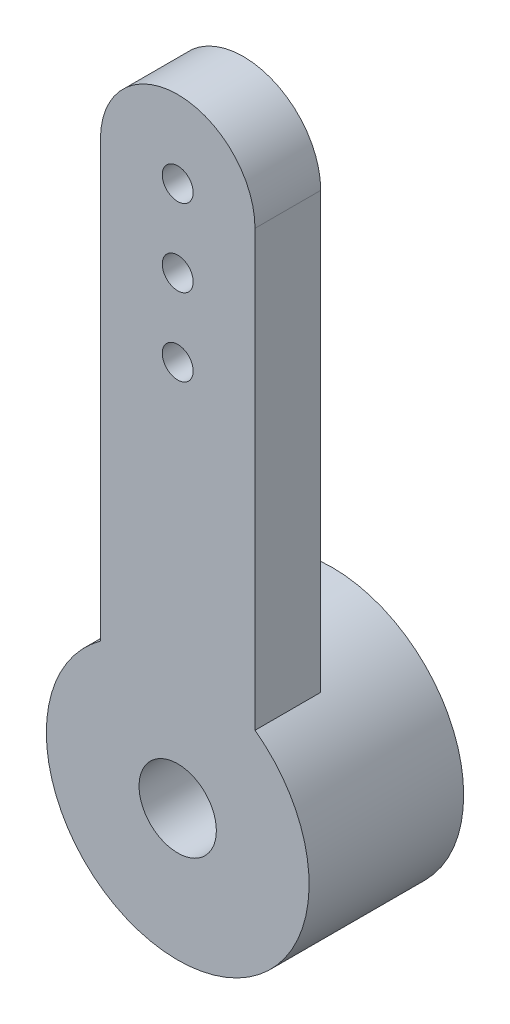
ISO-10303-21;
HEADER;
FILE_DESCRIPTION(('STEP AP214'),'2;1');
FILE_NAME('part.step','',(''),(''),'','','');
FILE_SCHEMA(('AUTOMOTIVE_DESIGN { 1 0 10303 214 1 1 1 1 }'));
ENDSEC;
DATA;
#1=APPLICATION_CONTEXT('core data for automotive mechanical design processes');
#2=APPLICATION_PROTOCOL_DEFINITION('international standard','automotive_design',2000,#1);
#3=PRODUCT_CONTEXT('',#1,'mechanical');
#4=PRODUCT('Part','Part','',(#3));
#5=PRODUCT_RELATED_PRODUCT_CATEGORY('part','',(#4));
#6=PRODUCT_DEFINITION_FORMATION('','',#4);
#7=PRODUCT_DEFINITION_CONTEXT('part definition',#1,'design');
#8=PRODUCT_DEFINITION('design','',#6,#7);
#9=PRODUCT_DEFINITION_SHAPE('','',#8);
#10=(LENGTH_UNIT() NAMED_UNIT(*) SI_UNIT(.MILLI.,.METRE.));
#11=(NAMED_UNIT(*) PLANE_ANGLE_UNIT() SI_UNIT($,.RADIAN.));
#12=(NAMED_UNIT(*) SI_UNIT($,.STERADIAN.) SOLID_ANGLE_UNIT());
#13=UNCERTAINTY_MEASURE_WITH_UNIT(LENGTH_MEASURE(1.E-05),#10,'distance_accuracy_value','');
#14=(GEOMETRIC_REPRESENTATION_CONTEXT(3) GLOBAL_UNCERTAINTY_ASSIGNED_CONTEXT((#13)) GLOBAL_UNIT_ASSIGNED_CONTEXT((#10,
#11,#12)) REPRESENTATION_CONTEXT('',''));
#15=CARTESIAN_POINT('',(0.,0.,0.));
#16=DIRECTION('',(0.,0.,1.));
#17=DIRECTION('',(1.,0.,0.));
#18=AXIS2_PLACEMENT_3D('',#15,#16,#17);
#19=CARTESIAN_POINT('',(0.,0.,0.));
#20=DIRECTION('',(0.,0.,1.));
#21=DIRECTION('',(1.,0.,0.));
#22=AXIS2_PLACEMENT_3D('',#19,#20,#21);
#23=PLANE('',#22);
#24=CARTESIAN_POINT('',(0.,0.,0.));
#25=DIRECTION('',(0.,0.,1.));
#26=DIRECTION('',(1.,0.,0.));
#27=AXIS2_PLACEMENT_3D('',#24,#25,#26);
#28=CIRCLE('',#27,1.);
#29=CARTESIAN_POINT('',(1.,0.,0.));
#30=VERTEX_POINT('',#29);
#31=EDGE_CURVE('E135',#30,#30,#28,.T.);
#32=ORIENTED_EDGE('',*,*,#31,.T.);
#33=EDGE_LOOP('',(#32));
#34=FACE_BOUND('',#33,.T.);
#35=CARTESIAN_POINT('',(0.,0.,0.));
#36=DIRECTION('',(0.,0.,-1.));
#37=DIRECTION('',(-1.,0.,0.));
#38=AXIS2_PLACEMENT_3D('',#35,#36,#37);
#39=CIRCLE('',#38,2.4);
#40=CARTESIAN_POINT('',(-2.4,0.,0.));
#41=VERTEX_POINT('',#40);
#42=EDGE_CURVE('E290',#41,#41,#39,.T.);
#43=ORIENTED_EDGE('',*,*,#42,.T.);
#44=EDGE_LOOP('',(#43));
#45=FACE_BOUND('',#44,.T.);
#46=ADVANCED_FACE('F33',(#34,#45),#23,.F.);
#47=CARTESIAN_POINT('',(0.,0.,1.7));
#48=DIRECTION('',(0.,0.,1.));
#49=DIRECTION('',(1.,0.,0.));
#50=AXIS2_PLACEMENT_3D('',#47,#48,#49);
#51=PLANE('',#50);
#52=CARTESIAN_POINT('',(0.,12.,1.7));
#53=DIRECTION('',(0.,0.,1.));
#54=DIRECTION('',(1.,0.,0.));
#55=AXIS2_PLACEMENT_3D('',#52,#53,#54);
#56=CIRCLE('',#55,0.4);
#57=CARTESIAN_POINT('',(0.400000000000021,12.,1.7));
#58=VERTEX_POINT('',#57);
#59=EDGE_CURVE('E126',#58,#58,#56,.T.);
#60=ORIENTED_EDGE('',*,*,#59,.F.);
#61=EDGE_LOOP('',(#60));
#62=FACE_BOUND('',#61,.T.);
#63=CARTESIAN_POINT('',(0.,0.,1.7));
#64=DIRECTION('',(0.,0.,1.));
#65=DIRECTION('',(1.,0.,0.));
#66=AXIS2_PLACEMENT_3D('',#63,#64,#65);
#67=CIRCLE('',#66,1.);
#68=CARTESIAN_POINT('',(1.,0.,1.7));
#69=VERTEX_POINT('',#68);
#70=EDGE_CURVE('E113',#69,#69,#67,.T.);
#71=ORIENTED_EDGE('',*,*,#70,.F.);
#72=EDGE_LOOP('',(#71));
#73=FACE_BOUND('',#72,.T.);
#74=CARTESIAN_POINT('',(0.,0.,1.7));
#75=DIRECTION('',(0.,0.,1.));
#76=DIRECTION('',(1.,0.,0.));
#77=AXIS2_PLACEMENT_3D('',#74,#75,#76);
#78=CIRCLE('',#77,3.4);
#79=CARTESIAN_POINT('',(-2.,2.7495454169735,1.7));
#80=VERTEX_POINT('',#79);
#81=CARTESIAN_POINT('',(2.,2.7495454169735,1.7));
#82=VERTEX_POINT('',#81);
#83=EDGE_CURVE('E99',#80,#82,#78,.T.);
#84=ORIENTED_EDGE('',*,*,#83,.T.);
#85=DIRECTION('',(0.,1.,0.));
#86=VECTOR('',#85,1.);
#87=CARTESIAN_POINT('',(2.,14.,1.7));
#88=LINE('',#87,#86);
#89=CARTESIAN_POINT('',(2.,14.,1.7));
#90=VERTEX_POINT('',#89);
#91=EDGE_CURVE('E78',#82,#90,#88,.T.);
#92=ORIENTED_EDGE('',*,*,#91,.T.);
#93=CARTESIAN_POINT('',(0.,14.,1.7));
#94=DIRECTION('',(0.,0.,1.));
#95=DIRECTION('',(1.,0.,0.));
#96=AXIS2_PLACEMENT_3D('',#93,#94,#95);
#97=CIRCLE('',#96,2.);
#98=CARTESIAN_POINT('',(-2.,14.,1.7));
#99=VERTEX_POINT('',#98);
#100=EDGE_CURVE('E103',#90,#99,#97,.T.);
#101=ORIENTED_EDGE('',*,*,#100,.T.);
#102=DIRECTION('',(0.,-1.,0.));
#103=VECTOR('',#102,1.);
#104=CARTESIAN_POINT('',(-2.,14.,1.7));
#105=LINE('',#104,#103);
#106=EDGE_CURVE('E52',#99,#80,#105,.T.);
#107=ORIENTED_EDGE('',*,*,#106,.T.);
#108=EDGE_LOOP('',(#84,#92,#101,#107));
#109=FACE_BOUND('',#108,.T.);
#110=CARTESIAN_POINT('',(0.,14.,1.7));
#111=DIRECTION('',(0.,0.,1.));
#112=DIRECTION('',(1.,0.,0.));
#113=AXIS2_PLACEMENT_3D('',#110,#111,#112);
#114=CIRCLE('',#113,0.4);
#115=CARTESIAN_POINT('',(0.4,14.,1.7));
#116=VERTEX_POINT('',#115);
#117=EDGE_CURVE('E132',#116,#116,#114,.T.);
#118=ORIENTED_EDGE('',*,*,#117,.F.);
#119=EDGE_LOOP('',(#118));
#120=FACE_BOUND('',#119,.T.);
#121=CARTESIAN_POINT('',(0.,10.,1.7));
#122=DIRECTION('',(0.,0.,1.));
#123=DIRECTION('',(1.,0.,0.));
#124=AXIS2_PLACEMENT_3D('',#121,#122,#123);
#125=CIRCLE('',#124,0.4);
#126=CARTESIAN_POINT('',(0.400000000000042,10.,1.7));
#127=VERTEX_POINT('',#126);
#128=EDGE_CURVE('E119',#127,#127,#125,.T.);
#129=ORIENTED_EDGE('',*,*,#128,.F.);
#130=EDGE_LOOP('',(#129));
#131=FACE_BOUND('',#130,.T.);
#132=ADVANCED_FACE('F146',(#62,#73,#109,#120,#131),#51,.T.);
#133=CARTESIAN_POINT('',(0.,0.,0.));
#134=DIRECTION('',(0.,0.,-1.));
#135=DIRECTION('',(-1.,0.,0.));
#136=AXIS2_PLACEMENT_3D('',#133,#134,#135);
#137=CIRCLE('',#136,3.4);
#138=CARTESIAN_POINT('',(-2.,2.7495454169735,0.));
#139=VERTEX_POINT('',#138);
#140=CARTESIAN_POINT('',(2.,2.7495454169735,0.));
#141=VERTEX_POINT('',#140);
#142=EDGE_CURVE('E83',#139,#141,#137,.T.);
#143=ORIENTED_EDGE('',*,*,#142,.F.);
#144=DIRECTION('',(0.,-1.,0.));
#145=VECTOR('',#144,1.);
#146=CARTESIAN_POINT('',(-2.,14.,0.));
#147=LINE('',#146,#145);
#148=CARTESIAN_POINT('',(-2.,14.,0.));
#149=VERTEX_POINT('',#148);
#150=EDGE_CURVE('E87',#149,#139,#147,.T.);
#151=ORIENTED_EDGE('',*,*,#150,.F.);
#152=CARTESIAN_POINT('',(0.,14.,0.));
#153=DIRECTION('',(0.,0.,1.));
#154=DIRECTION('',(1.,0.,0.));
#155=AXIS2_PLACEMENT_3D('',#152,#153,#154);
#156=CIRCLE('',#155,2.);
#157=CARTESIAN_POINT('',(2.,14.,0.));
#158=VERTEX_POINT('',#157);
#159=EDGE_CURVE('E73',#158,#149,#156,.T.);
#160=ORIENTED_EDGE('',*,*,#159,.F.);
#161=DIRECTION('',(0.,1.,0.));
#162=VECTOR('',#161,1.);
#163=CARTESIAN_POINT('',(2.,14.,0.));
#164=LINE('',#163,#162);
#165=EDGE_CURVE('E66',#141,#158,#164,.T.);
#166=ORIENTED_EDGE('',*,*,#165,.F.);
#167=EDGE_LOOP('',(#143,#151,#160,#166));
#168=FACE_BOUND('',#167,.T.);
#169=CARTESIAN_POINT('',(0.,14.,0.));
#170=DIRECTION('',(0.,0.,1.));
#171=DIRECTION('',(1.,0.,0.));
#172=AXIS2_PLACEMENT_3D('',#169,#170,#171);
#173=CIRCLE('',#172,0.4);
#174=CARTESIAN_POINT('',(0.4,14.,0.));
#175=VERTEX_POINT('',#174);
#176=EDGE_CURVE('E129',#175,#175,#173,.T.);
#177=ORIENTED_EDGE('',*,*,#176,.T.);
#178=EDGE_LOOP('',(#177));
#179=FACE_BOUND('',#178,.T.);
#180=CARTESIAN_POINT('',(0.,12.,0.));
#181=DIRECTION('',(0.,0.,1.));
#182=DIRECTION('',(1.,0.,0.));
#183=AXIS2_PLACEMENT_3D('',#180,#181,#182);
#184=CIRCLE('',#183,0.4);
#185=CARTESIAN_POINT('',(0.400000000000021,12.,0.));
#186=VERTEX_POINT('',#185);
#187=EDGE_CURVE('E122',#186,#186,#184,.T.);
#188=ORIENTED_EDGE('',*,*,#187,.T.);
#189=EDGE_LOOP('',(#188));
#190=FACE_BOUND('',#189,.T.);
#191=CARTESIAN_POINT('',(0.,10.,0.));
#192=DIRECTION('',(0.,0.,1.));
#193=DIRECTION('',(1.,0.,0.));
#194=AXIS2_PLACEMENT_3D('',#191,#192,#193);
#195=CIRCLE('',#194,0.4);
#196=CARTESIAN_POINT('',(0.400000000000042,10.,0.));
#197=VERTEX_POINT('',#196);
#198=EDGE_CURVE('E123',#197,#197,#195,.T.);
#199=ORIENTED_EDGE('',*,*,#198,.T.);
#200=EDGE_LOOP('',(#199));
#201=FACE_BOUND('',#200,.T.);
#202=ADVANCED_FACE('F85',(#168,#179,#190,#201),#23,.F.);
#203=CARTESIAN_POINT('',(0.,0.,1.7));
#204=DIRECTION('',(0.,0.,-1.));
#205=DIRECTION('',(-1.,0.,0.));
#206=AXIS2_PLACEMENT_3D('',#203,#204,#205);
#207=CYLINDRICAL_SURFACE('',#206,3.4);
#208=DIRECTION('',(0.,0.,-1.));
#209=VECTOR('',#208,1.);
#210=CARTESIAN_POINT('',(-2.,2.7495454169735,1.7));
#211=LINE('',#210,#209);
#212=EDGE_CURVE('E96',#80,#139,#211,.T.);
#213=ORIENTED_EDGE('',*,*,#212,.T.);
#214=ORIENTED_EDGE('',*,*,#142,.T.);
#215=DIRECTION('',(0.,0.,-1.));
#216=VECTOR('',#215,1.);
#217=CARTESIAN_POINT('',(2.,2.7495454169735,1.7));
#218=LINE('',#217,#216);
#219=EDGE_CURVE('E11',#82,#141,#218,.T.);
#220=ORIENTED_EDGE('',*,*,#219,.F.);
#221=ORIENTED_EDGE('',*,*,#83,.F.);
#222=EDGE_LOOP('',(#213,#214,#220,#221));
#223=FACE_BOUND('',#222,.T.);
#224=CARTESIAN_POINT('',(0.,0.,-2.3));
#225=DIRECTION('',(0.,0.,-1.));
#226=DIRECTION('',(-1.,0.,0.));
#227=AXIS2_PLACEMENT_3D('',#224,#225,#226);
#228=CIRCLE('',#227,3.4);
#229=CARTESIAN_POINT('',(-3.4,0.,-2.3));
#230=VERTEX_POINT('',#229);
#231=EDGE_CURVE('E91',#230,#230,#228,.T.);
#232=ORIENTED_EDGE('',*,*,#231,.F.);
#233=EDGE_LOOP('',(#232));
#234=FACE_BOUND('',#233,.T.);
#235=ADVANCED_FACE('F35',(#223,#234),#207,.T.);
#236=CARTESIAN_POINT('',(2.,14.,1.7));
#237=DIRECTION('',(-1.,0.,0.));
#238=DIRECTION('',(0.,-1.,0.));
#239=AXIS2_PLACEMENT_3D('',#236,#237,#238);
#240=PLANE('',#239);
#241=ORIENTED_EDGE('',*,*,#165,.T.);
#242=DIRECTION('',(0.,0.,-1.));
#243=VECTOR('',#242,1.);
#244=CARTESIAN_POINT('',(2.,14.,1.7));
#245=LINE('',#244,#243);
#246=EDGE_CURVE('E43',#90,#158,#245,.T.);
#247=ORIENTED_EDGE('',*,*,#246,.F.);
#248=ORIENTED_EDGE('',*,*,#91,.F.);
#249=ORIENTED_EDGE('',*,*,#219,.T.);
#250=EDGE_LOOP('',(#241,#247,#248,#249));
#251=FACE_BOUND('',#250,.T.);
#252=ADVANCED_FACE('F150',(#251),#240,.F.);
#253=CARTESIAN_POINT('',(0.,14.,1.7));
#254=DIRECTION('',(0.,0.,-1.));
#255=DIRECTION('',(-1.,0.,0.));
#256=AXIS2_PLACEMENT_3D('',#253,#254,#255);
#257=CYLINDRICAL_SURFACE('',#256,2.);
#258=ORIENTED_EDGE('',*,*,#159,.T.);
#259=DIRECTION('',(0.,0.,-1.));
#260=VECTOR('',#259,1.);
#261=CARTESIAN_POINT('',(-2.,14.,1.7));
#262=LINE('',#261,#260);
#263=EDGE_CURVE('E98',#99,#149,#262,.T.);
#264=ORIENTED_EDGE('',*,*,#263,.F.);
#265=ORIENTED_EDGE('',*,*,#100,.F.);
#266=ORIENTED_EDGE('',*,*,#246,.T.);
#267=EDGE_LOOP('',(#258,#264,#265,#266));
#268=FACE_BOUND('',#267,.T.);
#269=ADVANCED_FACE('F148',(#268),#257,.T.);
#270=CARTESIAN_POINT('',(-2.,14.,1.7));
#271=DIRECTION('',(1.,0.,0.));
#272=DIRECTION('',(0.,0.,-1.));
#273=AXIS2_PLACEMENT_3D('',#270,#271,#272);
#274=PLANE('',#273);
#275=ORIENTED_EDGE('',*,*,#150,.T.);
#276=ORIENTED_EDGE('',*,*,#212,.F.);
#277=ORIENTED_EDGE('',*,*,#106,.F.);
#278=ORIENTED_EDGE('',*,*,#263,.T.);
#279=EDGE_LOOP('',(#275,#276,#277,#278));
#280=FACE_BOUND('',#279,.T.);
#281=ADVANCED_FACE('F95',(#280),#274,.F.);
#282=CARTESIAN_POINT('',(0.,0.,1.7));
#283=DIRECTION('',(0.,0.,-1.));
#284=DIRECTION('',(-1.,0.,0.));
#285=AXIS2_PLACEMENT_3D('',#282,#283,#284);
#286=CYLINDRICAL_SURFACE('',#285,1.);
#287=ORIENTED_EDGE('',*,*,#70,.T.);
#288=EDGE_LOOP('',(#287));
#289=FACE_BOUND('',#288,.T.);
#290=ORIENTED_EDGE('',*,*,#31,.F.);
#291=EDGE_LOOP('',(#290));
#292=FACE_BOUND('',#291,.T.);
#293=ADVANCED_FACE('F156',(#289,#292),#286,.F.);
#294=CARTESIAN_POINT('',(0.,14.,1.7));
#295=DIRECTION('',(0.,0.,-1.));
#296=DIRECTION('',(-1.,0.,0.));
#297=AXIS2_PLACEMENT_3D('',#294,#295,#296);
#298=CYLINDRICAL_SURFACE('',#297,0.4);
#299=ORIENTED_EDGE('',*,*,#117,.T.);
#300=EDGE_LOOP('',(#299));
#301=FACE_BOUND('',#300,.T.);
#302=ORIENTED_EDGE('',*,*,#176,.F.);
#303=EDGE_LOOP('',(#302));
#304=FACE_BOUND('',#303,.T.);
#305=ADVANCED_FACE('F221',(#301,#304),#298,.F.);
#306=CARTESIAN_POINT('',(0.,12.,1.7));
#307=DIRECTION('',(0.,0.,-1.));
#308=DIRECTION('',(-1.,0.,0.));
#309=AXIS2_PLACEMENT_3D('',#306,#307,#308);
#310=CYLINDRICAL_SURFACE('',#309,0.4);
#311=ORIENTED_EDGE('',*,*,#59,.T.);
#312=EDGE_LOOP('',(#311));
#313=FACE_BOUND('',#312,.T.);
#314=ORIENTED_EDGE('',*,*,#187,.F.);
#315=EDGE_LOOP('',(#314));
#316=FACE_BOUND('',#315,.T.);
#317=ADVANCED_FACE('F217',(#313,#316),#310,.F.);
#318=CARTESIAN_POINT('',(0.,10.,1.7));
#319=DIRECTION('',(0.,0.,-1.));
#320=DIRECTION('',(-1.,0.,0.));
#321=AXIS2_PLACEMENT_3D('',#318,#319,#320);
#322=CYLINDRICAL_SURFACE('',#321,0.4);
#323=ORIENTED_EDGE('',*,*,#128,.T.);
#324=EDGE_LOOP('',(#323));
#325=FACE_BOUND('',#324,.T.);
#326=ORIENTED_EDGE('',*,*,#198,.F.);
#327=EDGE_LOOP('',(#326));
#328=FACE_BOUND('',#327,.T.);
#329=ADVANCED_FACE('F198',(#325,#328),#322,.F.);
#330=CARTESIAN_POINT('',(0.,0.,-2.3));
#331=DIRECTION('',(0.,0.,-1.));
#332=DIRECTION('',(-1.,0.,0.));
#333=AXIS2_PLACEMENT_3D('',#330,#331,#332);
#334=PLANE('',#333);
#335=ORIENTED_EDGE('',*,*,#231,.T.);
#336=EDGE_LOOP('',(#335));
#337=FACE_BOUND('',#336,.T.);
#338=CARTESIAN_POINT('',(0.,0.,-2.3));
#339=DIRECTION('',(0.,0.,-1.));
#340=DIRECTION('',(-1.,0.,0.));
#341=AXIS2_PLACEMENT_3D('',#338,#339,#340);
#342=CIRCLE('',#341,2.4);
#343=CARTESIAN_POINT('',(-2.4,0.,-2.3));
#344=VERTEX_POINT('',#343);
#345=EDGE_CURVE('E92',#344,#344,#342,.T.);
#346=ORIENTED_EDGE('',*,*,#345,.F.);
#347=EDGE_LOOP('',(#346));
#348=FACE_BOUND('',#347,.T.);
#349=ADVANCED_FACE('F192',(#337,#348),#334,.T.);
#350=CARTESIAN_POINT('',(0.,0.,-2.3));
#351=DIRECTION('',(0.,0.,1.));
#352=DIRECTION('',(1.,0.,0.));
#353=AXIS2_PLACEMENT_3D('',#350,#351,#352);
#354=CYLINDRICAL_SURFACE('',#353,2.4);
#355=ORIENTED_EDGE('',*,*,#345,.T.);
#356=EDGE_LOOP('',(#355));
#357=FACE_BOUND('',#356,.T.);
#358=ORIENTED_EDGE('',*,*,#42,.F.);
#359=EDGE_LOOP('',(#358));
#360=FACE_BOUND('',#359,.T.);
#361=ADVANCED_FACE('F197',(#357,#360),#354,.F.);
#362=CLOSED_SHELL('',(#46,#132,#202,#235,#252,#269,#281,#293,#305,#317,#329,#349,#361));
#363=MANIFOLD_SOLID_BREP('B2',#362);
#364=ADVANCED_BREP_SHAPE_REPRESENTATION('',(#18,#363),#14);
#365=SHAPE_DEFINITION_REPRESENTATION(#9,#364);
ENDSEC;
END-ISO-10303-21;
